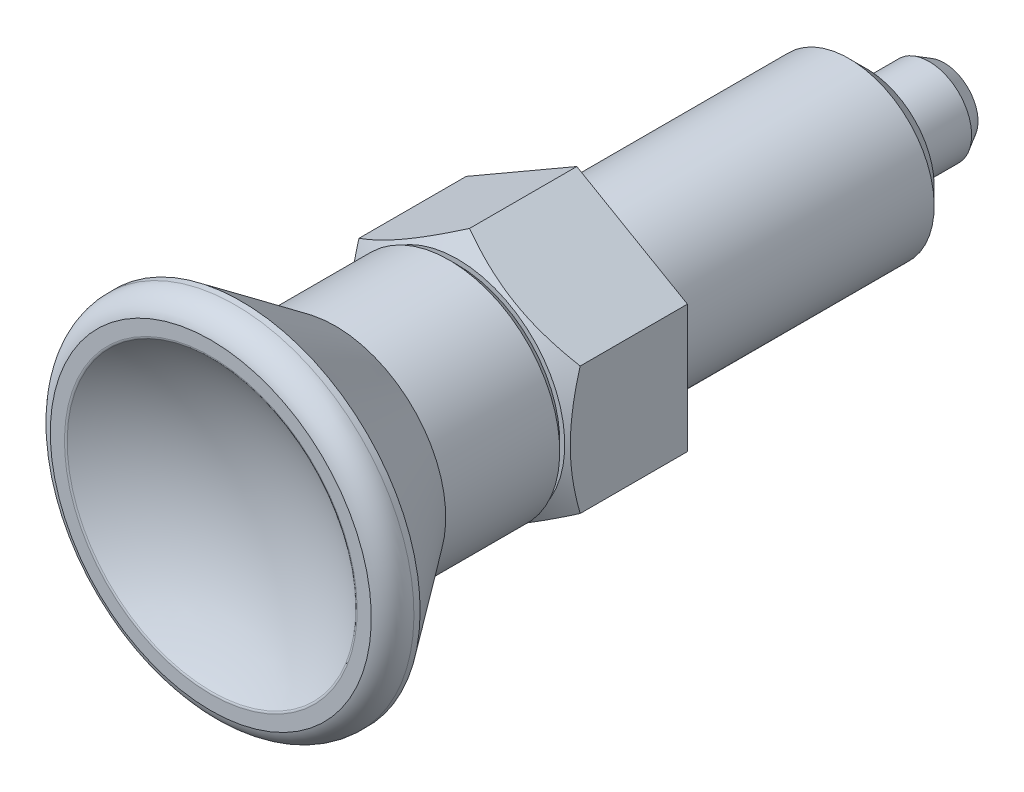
ISO-10303-21;
HEADER;
FILE_DESCRIPTION(('STEP AP214'),'2;1');
FILE_NAME('part.step','',(''),(''),'','','');
FILE_SCHEMA(('AUTOMOTIVE_DESIGN { 1 0 10303 214 1 1 1 1 }'));
ENDSEC;
DATA;
#1=APPLICATION_CONTEXT('core data for automotive mechanical design processes');
#2=APPLICATION_PROTOCOL_DEFINITION('international standard','automotive_design',2000,#1);
#3=PRODUCT_CONTEXT('',#1,'mechanical');
#4=PRODUCT('Part','Part','',(#3));
#5=PRODUCT_RELATED_PRODUCT_CATEGORY('part','',(#4));
#6=PRODUCT_DEFINITION_FORMATION('','',#4);
#7=PRODUCT_DEFINITION_CONTEXT('part definition',#1,'design');
#8=PRODUCT_DEFINITION('design','',#6,#7);
#9=PRODUCT_DEFINITION_SHAPE('','',#8);
#10=(LENGTH_UNIT() NAMED_UNIT(*) SI_UNIT(.MILLI.,.METRE.));
#11=(NAMED_UNIT(*) PLANE_ANGLE_UNIT() SI_UNIT($,.RADIAN.));
#12=(NAMED_UNIT(*) SI_UNIT($,.STERADIAN.) SOLID_ANGLE_UNIT());
#13=UNCERTAINTY_MEASURE_WITH_UNIT(LENGTH_MEASURE(1.E-05),#10,'distance_accuracy_value','');
#14=(GEOMETRIC_REPRESENTATION_CONTEXT(3) GLOBAL_UNCERTAINTY_ASSIGNED_CONTEXT((#13)) GLOBAL_UNIT_ASSIGNED_CONTEXT((#10,
#11,#12)) REPRESENTATION_CONTEXT('',''));
#15=CARTESIAN_POINT('',(0.,0.,0.));
#16=DIRECTION('',(0.,0.,1.));
#17=DIRECTION('',(1.,0.,0.));
#18=AXIS2_PLACEMENT_3D('',#15,#16,#17);
#19=CARTESIAN_POINT('',(0.,0.,-17.));
#20=DIRECTION('',(0.,0.,1.));
#21=DIRECTION('',(0.866025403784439,0.5,0.));
#22=AXIS2_PLACEMENT_3D('',#19,#20,#21);
#23=CONICAL_SURFACE('',#22,4.,0.785398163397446);
#24=CARTESIAN_POINT('',(0.,0.,-16.));
#25=DIRECTION('',(0.,0.,1.));
#26=DIRECTION('',(0.866025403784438,0.5,0.));
#27=AXIS2_PLACEMENT_3D('',#24,#25,#26);
#28=CIRCLE('',#27,5.);
#29=CARTESIAN_POINT('',(4.33012701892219,2.5,-16.));
#30=VERTEX_POINT('',#29);
#31=EDGE_CURVE('E117',#30,#30,#28,.T.);
#32=ORIENTED_EDGE('',*,*,#31,.F.);
#33=EDGE_LOOP('',(#32));
#34=FACE_BOUND('',#33,.T.);
#35=CARTESIAN_POINT('',(0.,0.,-17.));
#36=DIRECTION('',(0.,0.,-1.));
#37=DIRECTION('',(0.866025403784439,0.5,0.));
#38=AXIS2_PLACEMENT_3D('',#35,#36,#37);
#39=CIRCLE('',#38,4.);
#40=CARTESIAN_POINT('',(3.46410161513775,2.,-17.));
#41=VERTEX_POINT('',#40);
#42=EDGE_CURVE('E121',#41,#41,#39,.T.);
#43=ORIENTED_EDGE('',*,*,#42,.F.);
#44=EDGE_LOOP('',(#43));
#45=FACE_BOUND('',#44,.T.);
#46=ADVANCED_FACE('F14',(#34,#45),#23,.T.);
#47=CARTESIAN_POINT('',(0.,0.,0.));
#48=DIRECTION('',(0.,0.,-1.));
#49=DIRECTION('',(0.866025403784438,0.5,0.));
#50=AXIS2_PLACEMENT_3D('',#47,#48,#49);
#51=CYLINDRICAL_SURFACE('',#50,5.);
#52=CARTESIAN_POINT('',(0.,0.,0.));
#53=DIRECTION('',(0.,0.,1.));
#54=DIRECTION('',(0.866025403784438,0.5,0.));
#55=AXIS2_PLACEMENT_3D('',#52,#53,#54);
#56=CIRCLE('',#55,5.);
#57=CARTESIAN_POINT('',(4.33012701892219,2.5,0.));
#58=VERTEX_POINT('',#57);
#59=EDGE_CURVE('E111',#58,#58,#56,.T.);
#60=ORIENTED_EDGE('',*,*,#59,.F.);
#61=EDGE_LOOP('',(#60));
#62=FACE_BOUND('',#61,.T.);
#63=ORIENTED_EDGE('',*,*,#31,.T.);
#64=EDGE_LOOP('',(#63));
#65=FACE_BOUND('',#64,.T.);
#66=ADVANCED_FACE('F180',(#62,#65),#51,.T.);
#67=CARTESIAN_POINT('',(4.82365149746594,11.4451905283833,0.));
#68=DIRECTION('',(0.,0.,-1.));
#69=DIRECTION('',(0.5,-0.866025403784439,0.));
#70=AXIS2_PLACEMENT_3D('',#67,#68,#69);
#71=PLANE('',#70);
#72=DIRECTION('',(-0.866025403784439,-0.5,0.));
#73=VECTOR('',#72,1.);
#74=CARTESIAN_POINT('',(6.5,-3.75277674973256,0.));
#75=LINE('',#74,#73);
#76=CARTESIAN_POINT('',(6.5,-3.75277674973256,0.));
#77=VERTEX_POINT('',#76);
#78=CARTESIAN_POINT('',(0.,-7.50555349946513,0.));
#79=VERTEX_POINT('',#78);
#80=EDGE_CURVE('E607',#77,#79,#75,.T.);
#81=ORIENTED_EDGE('',*,*,#80,.T.);
#82=DIRECTION('',(-0.866025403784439,0.5,0.));
#83=VECTOR('',#82,1.);
#84=CARTESIAN_POINT('',(0.,-7.50555349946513,0.));
#85=LINE('',#84,#83);
#86=CARTESIAN_POINT('',(-6.5,-3.75277674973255,0.));
#87=VERTEX_POINT('',#86);
#88=EDGE_CURVE('E613',#79,#87,#85,.T.);
#89=ORIENTED_EDGE('',*,*,#88,.T.);
#90=DIRECTION('',(0.,1.,0.));
#91=VECTOR('',#90,1.);
#92=CARTESIAN_POINT('',(-6.5,-3.75277674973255,0.));
#93=LINE('',#92,#91);
#94=CARTESIAN_POINT('',(-6.5,3.75277674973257,0.));
#95=VERTEX_POINT('',#94);
#96=EDGE_CURVE('E81',#87,#95,#93,.T.);
#97=ORIENTED_EDGE('',*,*,#96,.T.);
#98=DIRECTION('',(0.866025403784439,0.5,0.));
#99=VECTOR('',#98,1.);
#100=CARTESIAN_POINT('',(-6.5,3.75277674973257,0.));
#101=LINE('',#100,#99);
#102=CARTESIAN_POINT('',(0.,7.50555349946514,0.));
#103=VERTEX_POINT('',#102);
#104=EDGE_CURVE('E86',#95,#103,#101,.T.);
#105=ORIENTED_EDGE('',*,*,#104,.T.);
#106=DIRECTION('',(0.866025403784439,-0.5,0.));
#107=VECTOR('',#106,1.);
#108=CARTESIAN_POINT('',(0.,7.50555349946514,0.));
#109=LINE('',#108,#107);
#110=CARTESIAN_POINT('',(6.5,3.75277674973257,0.));
#111=VERTEX_POINT('',#110);
#112=EDGE_CURVE('E90',#103,#111,#109,.T.);
#113=ORIENTED_EDGE('',*,*,#112,.T.);
#114=DIRECTION('',(0.,-1.,0.));
#115=VECTOR('',#114,1.);
#116=CARTESIAN_POINT('',(6.5,3.75277674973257,0.));
#117=LINE('',#116,#115);
#118=EDGE_CURVE('E106',#111,#77,#117,.T.);
#119=ORIENTED_EDGE('',*,*,#118,.T.);
#120=EDGE_LOOP('',(#81,#89,#97,#105,#113,#119));
#121=FACE_BOUND('',#120,.T.);
#122=ORIENTED_EDGE('',*,*,#59,.T.);
#123=EDGE_LOOP('',(#122));
#124=FACE_BOUND('',#123,.T.);
#125=ADVANCED_FACE('F87',(#121,#124),#71,.T.);
#126=CARTESIAN_POINT('',(0.,-7.50555349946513,7.));
#127=DIRECTION('',(-0.5,0.866025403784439,0.));
#128=DIRECTION('',(0.866025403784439,0.5,0.));
#129=AXIS2_PLACEMENT_3D('',#126,#127,#128);
#130=PLANE('',#129);
#131=DIRECTION('',(0.,0.,-1.));
#132=VECTOR('',#131,1.);
#133=CARTESIAN_POINT('',(0.,-7.50555349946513,6.3));
#134=LINE('',#133,#132);
#135=CARTESIAN_POINT('',(0.,-7.50555349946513,6.3));
#136=VERTEX_POINT('',#135);
#137=EDGE_CURVE('E573',#136,#79,#134,.T.);
#138=ORIENTED_EDGE('',*,*,#137,.T.);
#139=ORIENTED_EDGE('',*,*,#80,.F.);
#140=DIRECTION('',(0.,0.,1.));
#141=VECTOR('',#140,1.);
#142=CARTESIAN_POINT('',(6.5,-3.75277674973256,0.));
#143=LINE('',#142,#141);
#144=CARTESIAN_POINT('',(6.5,-3.75277674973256,6.3));
#145=VERTEX_POINT('',#144);
#146=EDGE_CURVE('E580',#77,#145,#143,.T.);
#147=ORIENTED_EDGE('',*,*,#146,.T.);
#148=CARTESIAN_POINT('',(0.,-7.50555349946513,6.3));
#149=CARTESIAN_POINT('',(3.25000000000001,-5.62916512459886,7.38333333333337));
#150=CARTESIAN_POINT('',(6.5,-3.75277674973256,6.3));
#151=(BOUNDED_CURVE() B_SPLINE_CURVE(2,(#148,#149,#150),.UNSPECIFIED.,.F.,
.F.) B_SPLINE_CURVE_WITH_KNOTS((3,3),(0.,1.),
.UNSPECIFIED.) CURVE() GEOMETRIC_REPRESENTATION_ITEM() RATIONAL_B_SPLINE_CURVE((1.,
1.15470053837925,1.)) REPRESENTATION_ITEM(''));
#152=EDGE_CURVE('E559',#136,#145,#151,.T.);
#153=ORIENTED_EDGE('',*,*,#152,.F.);
#154=EDGE_LOOP('',(#138,#139,#147,#153));
#155=FACE_BOUND('',#154,.T.);
#156=ADVANCED_FACE('F314',(#155),#130,.F.);
#157=CARTESIAN_POINT('',(-6.5,-3.75277674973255,7.));
#158=DIRECTION('',(0.5,0.866025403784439,0.));
#159=DIRECTION('',(0.866025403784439,-0.5,0.));
#160=AXIS2_PLACEMENT_3D('',#157,#158,#159);
#161=PLANE('',#160);
#162=DIRECTION('',(0.,0.,-1.));
#163=VECTOR('',#162,1.);
#164=CARTESIAN_POINT('',(-6.5,-3.75277674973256,6.3));
#165=LINE('',#164,#163);
#166=CARTESIAN_POINT('',(-6.5,-3.75277674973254,6.3));
#167=VERTEX_POINT('',#166);
#168=EDGE_CURVE('E587',#167,#87,#165,.T.);
#169=ORIENTED_EDGE('',*,*,#168,.T.);
#170=ORIENTED_EDGE('',*,*,#88,.F.);
#171=ORIENTED_EDGE('',*,*,#137,.F.);
#172=CARTESIAN_POINT('',(-6.5,-3.75277674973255,6.3));
#173=CARTESIAN_POINT('',(-3.25,-5.62916512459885,7.38333333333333));
#174=CARTESIAN_POINT('',(0.,-7.50555349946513,6.3));
#175=(BOUNDED_CURVE() B_SPLINE_CURVE(2,(#172,#173,#174),.UNSPECIFIED.,.F.,
.F.) B_SPLINE_CURVE_WITH_KNOTS((3,3),(0.,1.),
.UNSPECIFIED.) CURVE() GEOMETRIC_REPRESENTATION_ITEM() RATIONAL_B_SPLINE_CURVE((1.,
1.15470053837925,1.)) REPRESENTATION_ITEM(''));
#176=EDGE_CURVE('E552',#167,#136,#175,.T.);
#177=ORIENTED_EDGE('',*,*,#176,.F.);
#178=EDGE_LOOP('',(#169,#170,#171,#177));
#179=FACE_BOUND('',#178,.T.);
#180=ADVANCED_FACE('F339',(#179),#161,.F.);
#181=CARTESIAN_POINT('',(-6.5,3.75277674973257,7.));
#182=DIRECTION('',(1.,0.,0.));
#183=DIRECTION('',(0.,-1.,0.));
#184=AXIS2_PLACEMENT_3D('',#181,#182,#183);
#185=PLANE('',#184);
#186=DIRECTION('',(0.,0.,-1.));
#187=VECTOR('',#186,1.);
#188=CARTESIAN_POINT('',(-6.5,3.75277674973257,6.3));
#189=LINE('',#188,#187);
#190=CARTESIAN_POINT('',(-6.5,3.75277674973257,6.3));
#191=VERTEX_POINT('',#190);
#192=EDGE_CURVE('E99',#191,#95,#189,.T.);
#193=ORIENTED_EDGE('',*,*,#192,.T.);
#194=ORIENTED_EDGE('',*,*,#96,.F.);
#195=ORIENTED_EDGE('',*,*,#168,.F.);
#196=CARTESIAN_POINT('',(-6.5,3.75277674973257,6.3));
#197=CARTESIAN_POINT('',(-6.50000000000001,0.,7.38333333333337));
#198=CARTESIAN_POINT('',(-6.5,-3.75277674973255,6.3));
#199=(BOUNDED_CURVE() B_SPLINE_CURVE(2,(#196,#197,#198),.UNSPECIFIED.,.F.,
.F.) B_SPLINE_CURVE_WITH_KNOTS((3,3),(0.,1.),
.UNSPECIFIED.) CURVE() GEOMETRIC_REPRESENTATION_ITEM() RATIONAL_B_SPLINE_CURVE((1.,
1.15470053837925,1.)) REPRESENTATION_ITEM(''));
#200=EDGE_CURVE('E545',#191,#167,#199,.T.);
#201=ORIENTED_EDGE('',*,*,#200,.F.);
#202=EDGE_LOOP('',(#193,#194,#195,#201));
#203=FACE_BOUND('',#202,.T.);
#204=ADVANCED_FACE('F351',(#203),#185,.F.);
#205=CARTESIAN_POINT('',(0.,7.50555349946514,7.));
#206=DIRECTION('',(0.5,-0.866025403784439,0.));
#207=DIRECTION('',(-0.866025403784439,-0.5,0.));
#208=AXIS2_PLACEMENT_3D('',#205,#206,#207);
#209=PLANE('',#208);
#210=DIRECTION('',(0.,0.,-1.));
#211=VECTOR('',#210,1.);
#212=CARTESIAN_POINT('',(0.,7.50555349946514,6.3));
#213=LINE('',#212,#211);
#214=CARTESIAN_POINT('',(0.,7.50555349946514,6.3));
#215=VERTEX_POINT('',#214);
#216=EDGE_CURVE('E94',#215,#103,#213,.T.);
#217=ORIENTED_EDGE('',*,*,#216,.T.);
#218=ORIENTED_EDGE('',*,*,#104,.F.);
#219=ORIENTED_EDGE('',*,*,#192,.F.);
#220=CARTESIAN_POINT('',(0.,7.50555349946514,6.3));
#221=CARTESIAN_POINT('',(-3.25,5.62916512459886,7.38333333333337));
#222=CARTESIAN_POINT('',(-6.5,3.75277674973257,6.3));
#223=(BOUNDED_CURVE() B_SPLINE_CURVE(2,(#220,#221,#222),.UNSPECIFIED.,.F.,
.F.) B_SPLINE_CURVE_WITH_KNOTS((3,3),(0.,1.),
.UNSPECIFIED.) CURVE() GEOMETRIC_REPRESENTATION_ITEM() RATIONAL_B_SPLINE_CURVE((1.,
1.15470053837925,1.)) REPRESENTATION_ITEM(''));
#224=EDGE_CURVE('E39',#215,#191,#223,.T.);
#225=ORIENTED_EDGE('',*,*,#224,.F.);
#226=EDGE_LOOP('',(#217,#218,#219,#225));
#227=FACE_BOUND('',#226,.T.);
#228=ADVANCED_FACE('F95',(#227),#209,.F.);
#229=CARTESIAN_POINT('',(6.5,3.75277674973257,7.));
#230=DIRECTION('',(-0.5,-0.866025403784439,0.));
#231=DIRECTION('',(-0.866025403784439,0.5,0.));
#232=AXIS2_PLACEMENT_3D('',#229,#230,#231);
#233=PLANE('',#232);
#234=DIRECTION('',(0.,0.,-1.));
#235=VECTOR('',#234,1.);
#236=CARTESIAN_POINT('',(6.5,3.75277674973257,6.3));
#237=LINE('',#236,#235);
#238=CARTESIAN_POINT('',(6.5,3.75277674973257,6.3));
#239=VERTEX_POINT('',#238);
#240=EDGE_CURVE('E100',#239,#111,#237,.T.);
#241=ORIENTED_EDGE('',*,*,#240,.T.);
#242=ORIENTED_EDGE('',*,*,#112,.F.);
#243=ORIENTED_EDGE('',*,*,#216,.F.);
#244=CARTESIAN_POINT('',(6.5,3.75277674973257,6.3));
#245=CARTESIAN_POINT('',(3.25,5.62916512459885,7.38333333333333));
#246=CARTESIAN_POINT('',(0.,7.50555349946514,6.3));
#247=(BOUNDED_CURVE() B_SPLINE_CURVE(2,(#244,#245,#246),.UNSPECIFIED.,.F.,
.F.) B_SPLINE_CURVE_WITH_KNOTS((3,3),(0.,1.),
.UNSPECIFIED.) CURVE() GEOMETRIC_REPRESENTATION_ITEM() RATIONAL_B_SPLINE_CURVE((1.,
1.15470053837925,1.)) REPRESENTATION_ITEM(''));
#248=EDGE_CURVE('E534',#239,#215,#247,.T.);
#249=ORIENTED_EDGE('',*,*,#248,.F.);
#250=EDGE_LOOP('',(#241,#242,#243,#249));
#251=FACE_BOUND('',#250,.T.);
#252=ADVANCED_FACE('F103',(#251),#233,.F.);
#253=CARTESIAN_POINT('',(6.5,-3.75277674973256,7.));
#254=DIRECTION('',(-1.,0.,0.));
#255=DIRECTION('',(0.,1.,0.));
#256=AXIS2_PLACEMENT_3D('',#253,#254,#255);
#257=PLANE('',#256);
#258=ORIENTED_EDGE('',*,*,#146,.F.);
#259=ORIENTED_EDGE('',*,*,#118,.F.);
#260=ORIENTED_EDGE('',*,*,#240,.F.);
#261=CARTESIAN_POINT('',(6.5,-3.75277674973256,6.3));
#262=CARTESIAN_POINT('',(6.50000000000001,0.,7.38333333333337));
#263=CARTESIAN_POINT('',(6.5,3.75277674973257,6.3));
#264=(BOUNDED_CURVE() B_SPLINE_CURVE(2,(#261,#262,#263),.UNSPECIFIED.,.F.,
.F.) B_SPLINE_CURVE_WITH_KNOTS((3,3),(0.,1.),
.UNSPECIFIED.) CURVE() GEOMETRIC_REPRESENTATION_ITEM() RATIONAL_B_SPLINE_CURVE((1.,
1.15470053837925,1.)) REPRESENTATION_ITEM(''));
#265=EDGE_CURVE('E566',#145,#239,#264,.T.);
#266=ORIENTED_EDGE('',*,*,#265,.F.);
#267=EDGE_LOOP('',(#258,#259,#260,#266));
#268=FACE_BOUND('',#267,.T.);
#269=ADVANCED_FACE('F315',(#268),#257,.F.);
#270=CARTESIAN_POINT('',(0.,0.,7.));
#271=DIRECTION('',(0.,0.,-1.));
#272=DIRECTION('',(0.866025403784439,0.5,0.));
#273=AXIS2_PLACEMENT_3D('',#270,#271,#272);
#274=CONICAL_SURFACE('',#273,6.29311793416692,1.0471975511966);
#275=ORIENTED_EDGE('',*,*,#248,.T.);
#276=ORIENTED_EDGE('',*,*,#224,.T.);
#277=ORIENTED_EDGE('',*,*,#200,.T.);
#278=ORIENTED_EDGE('',*,*,#176,.T.);
#279=ORIENTED_EDGE('',*,*,#152,.T.);
#280=ORIENTED_EDGE('',*,*,#265,.T.);
#281=EDGE_LOOP('',(#275,#276,#277,#278,#279,#280));
#282=FACE_BOUND('',#281,.T.);
#283=CARTESIAN_POINT('',(0.,0.,7.));
#284=DIRECTION('',(0.,0.,1.));
#285=DIRECTION('',(0.866025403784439,0.5,0.));
#286=AXIS2_PLACEMENT_3D('',#283,#284,#285);
#287=CIRCLE('',#286,6.29311793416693);
#288=CARTESIAN_POINT('',(5.45000000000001,3.14655896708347,7.));
#289=VERTEX_POINT('',#288);
#290=EDGE_CURVE('E128',#289,#289,#287,.T.);
#291=ORIENTED_EDGE('',*,*,#290,.F.);
#292=EDGE_LOOP('',(#291));
#293=FACE_BOUND('',#292,.T.);
#294=ADVANCED_FACE('F326',(#282,#293),#274,.T.);
#295=CARTESIAN_POINT('',(-10.0660254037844,2.84863156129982,7.));
#296=DIRECTION('',(0.,0.,1.));
#297=DIRECTION('',(0.5,-0.866025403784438,0.));
#298=AXIS2_PLACEMENT_3D('',#295,#296,#297);
#299=PLANE('',#298);
#300=CARTESIAN_POINT('',(-5.69289711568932E-13,-3.32453899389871E-13,7.));
#301=DIRECTION('',(0.,0.,1.));
#302=DIRECTION('',(0.5,-0.866025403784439,0.));
#303=AXIS2_PLACEMENT_3D('',#300,#301,#302);
#304=CIRCLE('',#303,6.);
#305=CARTESIAN_POINT('',(2.99999999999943,-5.19615242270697,7.));
#306=VERTEX_POINT('',#305);
#307=EDGE_CURVE('E126',#306,#306,#304,.T.);
#308=ORIENTED_EDGE('',*,*,#307,.F.);
#309=EDGE_LOOP('',(#308));
#310=FACE_BOUND('',#309,.T.);
#311=ORIENTED_EDGE('',*,*,#290,.T.);
#312=EDGE_LOOP('',(#311));
#313=FACE_BOUND('',#312,.T.);
#314=ADVANCED_FACE('F392',(#310,#313),#299,.T.);
#315=CARTESIAN_POINT('',(-5.70522859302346E-13,-3.30318024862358E-13,7.));
#316=DIRECTION('',(0.,0.,1.));
#317=DIRECTION('',(0.866025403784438,0.5,0.));
#318=AXIS2_PLACEMENT_3D('',#315,#316,#317);
#319=CONICAL_SURFACE('',#318,6.,0.785398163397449);
#320=CARTESIAN_POINT('',(-5.75894302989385E-13,-3.38258883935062E-13,7.5));
#321=DIRECTION('',(0.,0.,1.));
#322=DIRECTION('',(0.866025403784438,0.5,0.));
#323=AXIS2_PLACEMENT_3D('',#320,#321,#322);
#324=CIRCLE('',#323,6.5);
#325=CARTESIAN_POINT('',(5.62916512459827,3.24999999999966,7.5));
#326=VERTEX_POINT('',#325);
#327=EDGE_CURVE('E125',#326,#326,#324,.T.);
#328=ORIENTED_EDGE('',*,*,#327,.F.);
#329=EDGE_LOOP('',(#328));
#330=FACE_BOUND('',#329,.T.);
#331=ORIENTED_EDGE('',*,*,#307,.T.);
#332=EDGE_LOOP('',(#331));
#333=FACE_BOUND('',#332,.T.);
#334=ADVANCED_FACE('F403',(#330,#333),#319,.T.);
#335=CARTESIAN_POINT('',(-5.71528897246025E-13,-3.31604893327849E-13,14.2));
#336=DIRECTION('',(0.,0.,-1.));
#337=DIRECTION('',(0.866025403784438,0.5,0.));
#338=AXIS2_PLACEMENT_3D('',#335,#336,#337);
#339=CYLINDRICAL_SURFACE('',#338,6.5);
#340=ORIENTED_EDGE('',*,*,#327,.T.);
#341=EDGE_LOOP('',(#340));
#342=FACE_BOUND('',#341,.T.);
#343=CARTESIAN_POINT('',(-5.70172641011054E-13,-3.30821858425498E-13,14.2));
#344=DIRECTION('',(0.,0.,-1.));
#345=DIRECTION('',(0.866025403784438,0.5,0.));
#346=AXIS2_PLACEMENT_3D('',#343,#344,#345);
#347=CIRCLE('',#346,6.5);
#348=CARTESIAN_POINT('',(5.62916512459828,3.24999999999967,14.2));
#349=VERTEX_POINT('',#348);
#350=EDGE_CURVE('E646',#349,#349,#347,.T.);
#351=ORIENTED_EDGE('',*,*,#350,.T.);
#352=EDGE_LOOP('',(#351));
#353=FACE_BOUND('',#352,.T.);
#354=ADVANCED_FACE('F464',(#342,#353),#339,.T.);
#355=CARTESIAN_POINT('',(-5.70879547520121E-13,-3.29597460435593E-13,14.2));
#356=DIRECTION('',(0.,0.,1.));
#357=DIRECTION('',(0.866025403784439,0.5,0.));
#358=AXIS2_PLACEMENT_3D('',#355,#356,#357);
#359=CONICAL_SURFACE('',#358,6.5,0.628318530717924);
#360=CARTESIAN_POINT('',(-5.70053822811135E-13,-3.27558210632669E-13,19.7055276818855));
#361=DIRECTION('',(0.,0.,-1.));
#362=DIRECTION('',(0.866025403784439,0.5,0.));
#363=AXIS2_PLACEMENT_3D('',#360,#361,#362);
#364=CIRCLE('',#363,10.5);
#365=CARTESIAN_POINT('',(9.09326673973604,5.24999999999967,19.7055276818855));
#366=VERTEX_POINT('',#365);
#367=EDGE_CURVE('E653',#366,#366,#364,.T.);
#368=ORIENTED_EDGE('',*,*,#367,.T.);
#369=EDGE_LOOP('',(#368));
#370=FACE_BOUND('',#369,.T.);
#371=ORIENTED_EDGE('',*,*,#350,.F.);
#372=EDGE_LOOP('',(#371));
#373=FACE_BOUND('',#372,.T.);
#374=ADVANCED_FACE('F452',(#370,#373),#359,.T.);
#375=CARTESIAN_POINT('',(-5.68670343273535E-13,-3.30017063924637E-13,20.0689935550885));
#376=DIRECTION('',(0.,0.,-1.));
#377=DIRECTION('',(0.866025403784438,0.5,0.));
#378=AXIS2_PLACEMENT_3D('',#375,#376,#377);
#379=CYLINDRICAL_SURFACE('',#378,10.5);
#380=CARTESIAN_POINT('',(-5.67521473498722E-13,-3.28474921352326E-13,20.0689935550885));
#381=DIRECTION('',(0.,0.,-1.));
#382=DIRECTION('',(0.866025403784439,0.5,0.));
#383=AXIS2_PLACEMENT_3D('',#380,#381,#382);
#384=CIRCLE('',#383,10.5);
#385=CARTESIAN_POINT('',(9.09326673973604,5.24999999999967,20.0689935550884));
#386=VERTEX_POINT('',#385);
#387=EDGE_CURVE('E660',#386,#386,#384,.T.);
#388=ORIENTED_EDGE('',*,*,#387,.T.);
#389=EDGE_LOOP('',(#388));
#390=FACE_BOUND('',#389,.T.);
#391=ORIENTED_EDGE('',*,*,#367,.F.);
#392=EDGE_LOOP('',(#391));
#393=FACE_BOUND('',#392,.T.);
#394=ADVANCED_FACE('F441',(#390,#393),#379,.T.);
#395=CARTESIAN_POINT('',(-5.61183044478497E-13,-3.29597460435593E-13,20.0689935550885));
#396=DIRECTION('',(0.,0.,-1.));
#397=DIRECTION('',(-1.,0.,0.));
#398=AXIS2_PLACEMENT_3D('',#395,#396,#397);
#399=TOROIDAL_SURFACE('',#398,9.00000000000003,1.49999999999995);
#400=CARTESIAN_POINT('',(-5.70879547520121E-13,-3.29597460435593E-13,21.5055276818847));
#401=DIRECTION('',(0.,0.,-1.));
#402=DIRECTION('',(0.866025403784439,0.5,0.));
#403=AXIS2_PLACEMENT_3D('',#400,#401,#402);
#404=CIRCLE('',#403,9.43170557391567);
#405=CARTESIAN_POINT('',(8.16809662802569,4.71585278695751,21.5055276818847));
#406=VERTEX_POINT('',#405);
#407=EDGE_CURVE('E667',#406,#406,#404,.T.);
#408=ORIENTED_EDGE('',*,*,#407,.T.);
#409=EDGE_LOOP('',(#408));
#410=FACE_BOUND('',#409,.T.);
#411=ORIENTED_EDGE('',*,*,#387,.F.);
#412=EDGE_LOOP('',(#411));
#413=FACE_BOUND('',#412,.T.);
#414=ADVANCED_FACE('F430',(#410,#413),#399,.T.);
#415=CARTESIAN_POINT('',(-3.79746822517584,-14.1723443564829,21.5055276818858));
#416=DIRECTION('',(0.,0.,1.));
#417=DIRECTION('',(0.866025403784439,0.5,0.));
#418=AXIS2_PLACEMENT_3D('',#415,#416,#417);
#419=PLANE('',#418);
#420=ORIENTED_EDGE('',*,*,#407,.F.);
#421=EDGE_LOOP('',(#420));
#422=FACE_BOUND('',#421,.T.);
#423=CARTESIAN_POINT('',(-5.73266855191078E-13,-3.35870863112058E-13,21.5055276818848));
#424=DIRECTION('',(0.,0.,1.));
#425=DIRECTION('',(0.866025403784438,0.5,0.));
#426=AXIS2_PLACEMENT_3D('',#423,#424,#425);
#427=CIRCLE('',#426,8.59941858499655);
#428=CARTESIAN_POINT('',(7.44731495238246,4.29970929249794,21.5055276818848));
#429=VERTEX_POINT('',#428);
#430=EDGE_CURVE('E680',#429,#429,#427,.T.);
#431=ORIENTED_EDGE('',*,*,#430,.F.);
#432=EDGE_LOOP('',(#431));
#433=FACE_BOUND('',#432,.T.);
#434=ADVANCED_FACE('F419',(#422,#433),#419,.T.);
#435=CARTESIAN_POINT('',(-5.67254576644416E-13,-3.3133218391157E-13,21.3055276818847));
#436=DIRECTION('',(0.,0.,-1.));
#437=DIRECTION('',(-1.,0.,0.));
#438=AXIS2_PLACEMENT_3D('',#435,#436,#437);
#439=TOROIDAL_SURFACE('',#438,8.59941858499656,0.200000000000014);
#440=CARTESIAN_POINT('',(-5.68298845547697E-13,-3.27128473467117E-13,21.4646826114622));
#441=DIRECTION('',(0.,0.,-1.));
#442=DIRECTION('',(0.866025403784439,0.5,0.));
#443=AXIS2_PLACEMENT_3D('',#440,#441,#442);
#444=CIRCLE('',#443,8.47830001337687);
#445=CARTESIAN_POINT('',(7.34242319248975,4.23915000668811,21.4646826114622));
#446=VERTEX_POINT('',#445);
#447=EDGE_CURVE('E674',#446,#446,#444,.T.);
#448=ORIENTED_EDGE('',*,*,#447,.T.);
#449=EDGE_LOOP('',(#448));
#450=FACE_BOUND('',#449,.T.);
#451=ORIENTED_EDGE('',*,*,#430,.T.);
#452=EDGE_LOOP('',(#451));
#453=FACE_BOUND('',#452,.T.);
#454=ADVANCED_FACE('F175',(#450,#453),#439,.T.);
#455=CARTESIAN_POINT('',(-6.1895361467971E-13,-3.57353036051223E-13,32.6055276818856));
#456=DIRECTION('',(0.,0.,-1.));
#457=DIRECTION('',(0.866025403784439,0.5,0.));
#458=AXIS2_PLACEMENT_3D('',#455,#456,#457);
#459=SPHERICAL_SURFACE('',#458,14.0000000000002);
#460=ORIENTED_EDGE('',*,*,#447,.F.);
#461=EDGE_LOOP('',(#460));
#462=FACE_BOUND('',#461,.T.);
#463=ADVANCED_FACE('F164',(#462),#459,.F.);
#464=CARTESIAN_POINT('',(0.,0.,-17.));
#465=DIRECTION('',(0.,0.,-1.));
#466=DIRECTION('',(-0.866025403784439,-0.5,0.));
#467=AXIS2_PLACEMENT_3D('',#464,#465,#466);
#468=SPHERICAL_SURFACE('',#467,5.00000000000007);
#469=CARTESIAN_POINT('',(0.,0.,-21.588122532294));
#470=DIRECTION('',(0.,0.,1.));
#471=DIRECTION('',(-0.866025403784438,-0.5,0.));
#472=AXIS2_PLACEMENT_3D('',#469,#470,#471);
#473=CIRCLE('',#472,1.9872422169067);
#474=CARTESIAN_POINT('',(-1.7210022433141,-0.993621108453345,-21.588122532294));
#475=VERTEX_POINT('',#474);
#476=EDGE_CURVE('E18',#475,#475,#473,.T.);
#477=ORIENTED_EDGE('',*,*,#476,.F.);
#478=EDGE_LOOP('',(#477));
#479=FACE_BOUND('',#478,.T.);
#480=ADVANCED_FACE('F162',(#479),#468,.T.);
#481=CARTESIAN_POINT('',(0.,0.,-21.588122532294));
#482=DIRECTION('',(0.,0.,1.));
#483=DIRECTION('',(-0.866025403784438,-0.5,0.));
#484=AXIS2_PLACEMENT_3D('',#481,#482,#483);
#485=CONICAL_SURFACE('',#484,1.9872422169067,0.523598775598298);
#486=CARTESIAN_POINT('',(0.,0.,-20.7));
#487=DIRECTION('',(0.,0.,1.));
#488=DIRECTION('',(-0.866025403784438,-0.5,0.));
#489=AXIS2_PLACEMENT_3D('',#486,#487,#488);
#490=CIRCLE('',#489,2.5);
#491=CARTESIAN_POINT('',(-2.16506350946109,-1.25,-20.7));
#492=VERTEX_POINT('',#491);
#493=EDGE_CURVE('E144',#492,#492,#490,.T.);
#494=ORIENTED_EDGE('',*,*,#493,.F.);
#495=EDGE_LOOP('',(#494));
#496=FACE_BOUND('',#495,.T.);
#497=ORIENTED_EDGE('',*,*,#476,.T.);
#498=EDGE_LOOP('',(#497));
#499=FACE_BOUND('',#498,.T.);
#500=ADVANCED_FACE('F160',(#496,#499),#485,.T.);
#501=CARTESIAN_POINT('',(0.,0.,-17.5));
#502=DIRECTION('',(0.,0.,-1.));
#503=DIRECTION('',(-0.866025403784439,-0.5,0.));
#504=AXIS2_PLACEMENT_3D('',#501,#502,#503);
#505=CYLINDRICAL_SURFACE('',#504,2.5);
#506=CARTESIAN_POINT('',(0.,0.,-17.5));
#507=DIRECTION('',(0.,0.,1.));
#508=DIRECTION('',(-0.866025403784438,-0.5,0.));
#509=AXIS2_PLACEMENT_3D('',#506,#507,#508);
#510=CIRCLE('',#509,2.5);
#511=CARTESIAN_POINT('',(-2.16506350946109,-1.25,-17.5));
#512=VERTEX_POINT('',#511);
#513=EDGE_CURVE('E141',#512,#512,#510,.T.);
#514=ORIENTED_EDGE('',*,*,#513,.F.);
#515=EDGE_LOOP('',(#514));
#516=FACE_BOUND('',#515,.T.);
#517=ORIENTED_EDGE('',*,*,#493,.T.);
#518=EDGE_LOOP('',(#517));
#519=FACE_BOUND('',#518,.T.);
#520=ADVANCED_FACE('F172',(#516,#519),#505,.T.);
#521=CARTESIAN_POINT('',(0.,0.,-17.3732050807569));
#522=DIRECTION('',(0.,0.,-1.));
#523=DIRECTION('',(-0.866025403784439,-0.5,0.));
#524=AXIS2_PLACEMENT_3D('',#521,#522,#523);
#525=CONICAL_SURFACE('',#524,2.42679491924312,0.523598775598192);
#526=CARTESIAN_POINT('',(0.,0.,-17.3732050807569));
#527=DIRECTION('',(0.,0.,1.));
#528=DIRECTION('',(-0.866025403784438,-0.5,0.));
#529=AXIS2_PLACEMENT_3D('',#526,#527,#528);
#530=CIRCLE('',#529,2.42679491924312);
#531=CARTESIAN_POINT('',(-2.10166604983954,-1.21339745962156,-17.3732050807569));
#532=VERTEX_POINT('',#531);
#533=EDGE_CURVE('E137',#532,#532,#530,.T.);
#534=ORIENTED_EDGE('',*,*,#533,.F.);
#535=EDGE_LOOP('',(#534));
#536=FACE_BOUND('',#535,.T.);
#537=ORIENTED_EDGE('',*,*,#513,.T.);
#538=EDGE_LOOP('',(#537));
#539=FACE_BOUND('',#538,.T.);
#540=ADVANCED_FACE('F202',(#536,#539),#525,.T.);
#541=CARTESIAN_POINT('',(0.,0.,-17.2732050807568));
#542=DIRECTION('',(0.,0.,-1.));
#543=DIRECTION('',(-1.,0.,0.));
#544=AXIS2_PLACEMENT_3D('',#541,#542,#543);
#545=TOROIDAL_SURFACE('',#544,2.6000000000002,0.200000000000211);
#546=CARTESIAN_POINT('',(0.,0.,-17.2732050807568));
#547=DIRECTION('',(0.,0.,1.));
#548=DIRECTION('',(-0.866025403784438,-0.5,0.));
#549=AXIS2_PLACEMENT_3D('',#546,#547,#548);
#550=CIRCLE('',#549,2.4);
#551=CARTESIAN_POINT('',(-2.07846096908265,-1.2,-17.2732050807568));
#552=VERTEX_POINT('',#551);
#553=EDGE_CURVE('E133',#552,#552,#550,.T.);
#554=ORIENTED_EDGE('',*,*,#553,.F.);
#555=EDGE_LOOP('',(#554));
#556=FACE_BOUND('',#555,.T.);
#557=ORIENTED_EDGE('',*,*,#533,.T.);
#558=EDGE_LOOP('',(#557));
#559=FACE_BOUND('',#558,.T.);
#560=ADVANCED_FACE('F200',(#556,#559),#545,.F.);
#561=CARTESIAN_POINT('',(0.,0.,-17.2));
#562=DIRECTION('',(0.,0.,-1.));
#563=DIRECTION('',(-0.866025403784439,-0.5,0.));
#564=AXIS2_PLACEMENT_3D('',#561,#562,#563);
#565=CYLINDRICAL_SURFACE('',#564,2.4);
#566=CARTESIAN_POINT('',(0.,0.,-17.2));
#567=DIRECTION('',(0.,0.,1.));
#568=DIRECTION('',(-0.866025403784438,-0.5,0.));
#569=AXIS2_PLACEMENT_3D('',#566,#567,#568);
#570=CIRCLE('',#569,2.4);
#571=CARTESIAN_POINT('',(-2.07846096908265,-1.2,-17.2));
#572=VERTEX_POINT('',#571);
#573=EDGE_CURVE('E25',#572,#572,#570,.T.);
#574=ORIENTED_EDGE('',*,*,#573,.F.);
#575=EDGE_LOOP('',(#574));
#576=FACE_BOUND('',#575,.T.);
#577=ORIENTED_EDGE('',*,*,#553,.T.);
#578=EDGE_LOOP('',(#577));
#579=FACE_BOUND('',#578,.T.);
#580=ADVANCED_FACE('F197',(#576,#579),#565,.T.);
#581=CARTESIAN_POINT('',(0.,0.,-17.2));
#582=DIRECTION('',(0.,0.,-1.));
#583=DIRECTION('',(-1.,0.,0.));
#584=AXIS2_PLACEMENT_3D('',#581,#582,#583);
#585=TOROIDAL_SURFACE('',#584,2.59999999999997,0.199999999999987);
#586=CARTESIAN_POINT('',(0.,0.,-17.));
#587=DIRECTION('',(0.,0.,1.));
#588=DIRECTION('',(-0.866025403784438,-0.5,0.));
#589=AXIS2_PLACEMENT_3D('',#586,#587,#588);
#590=CIRCLE('',#589,2.6);
#591=CARTESIAN_POINT('',(-2.25166604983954,-1.3,-17.));
#592=VERTEX_POINT('',#591);
#593=EDGE_CURVE('E9',#592,#592,#590,.T.);
#594=ORIENTED_EDGE('',*,*,#593,.F.);
#595=EDGE_LOOP('',(#594));
#596=FACE_BOUND('',#595,.T.);
#597=ORIENTED_EDGE('',*,*,#573,.T.);
#598=EDGE_LOOP('',(#597));
#599=FACE_BOUND('',#598,.T.);
#600=ADVANCED_FACE('F16',(#596,#599),#585,.F.);
#601=CARTESIAN_POINT('',(4.24762103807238,-1.13814662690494,-17.));
#602=DIRECTION('',(0.,0.,-1.));
#603=DIRECTION('',(-0.866025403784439,-0.5,0.));
#604=AXIS2_PLACEMENT_3D('',#601,#602,#603);
#605=PLANE('',#604);
#606=ORIENTED_EDGE('',*,*,#593,.T.);
#607=EDGE_LOOP('',(#606));
#608=FACE_BOUND('',#607,.T.);
#609=ORIENTED_EDGE('',*,*,#42,.T.);
#610=EDGE_LOOP('',(#609));
#611=FACE_BOUND('',#610,.T.);
#612=ADVANCED_FACE('F193',(#608,#611),#605,.T.);
#613=CLOSED_SHELL('',(#46,#66,#125,#156,#180,#204,#228,#252,#269,#294,#314,#334,#354,#374,#394,
#414,#434,#454,#463,#480,#500,#520,#540,#560,#580,#600,#612));
#614=MANIFOLD_SOLID_BREP('B1',#613);
#615=ADVANCED_BREP_SHAPE_REPRESENTATION('',(#18,#614),#14);
#616=SHAPE_DEFINITION_REPRESENTATION(#9,#615);
ENDSEC;
END-ISO-10303-21;
